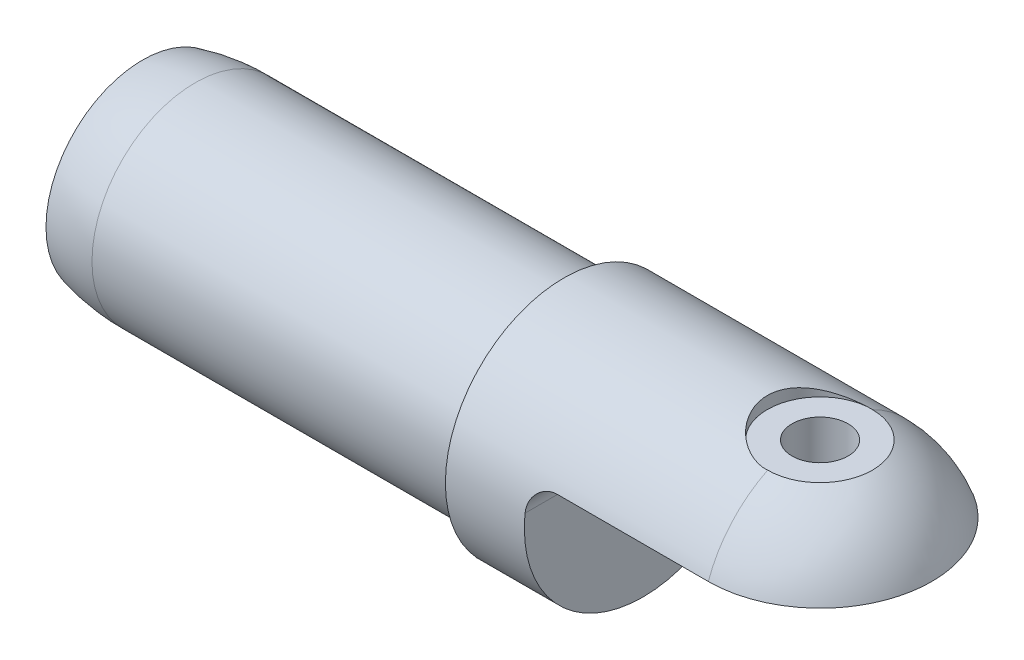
ISO-10303-21;
HEADER;
FILE_DESCRIPTION(('STEP AP214'),'2;1');
FILE_NAME('part.step','',(''),(''),'','','');
FILE_SCHEMA(('AUTOMOTIVE_DESIGN { 1 0 10303 214 1 1 1 1 }'));
ENDSEC;
DATA;
#1=APPLICATION_CONTEXT('core data for automotive mechanical design processes');
#2=APPLICATION_PROTOCOL_DEFINITION('international standard','automotive_design',2000,#1);
#3=PRODUCT_CONTEXT('',#1,'mechanical');
#4=PRODUCT('Part','Part','',(#3));
#5=PRODUCT_RELATED_PRODUCT_CATEGORY('part','',(#4));
#6=PRODUCT_DEFINITION_FORMATION('','',#4);
#7=PRODUCT_DEFINITION_CONTEXT('part definition',#1,'design');
#8=PRODUCT_DEFINITION('design','',#6,#7);
#9=PRODUCT_DEFINITION_SHAPE('','',#8);
#10=(LENGTH_UNIT() NAMED_UNIT(*) SI_UNIT(.MILLI.,.METRE.));
#11=(NAMED_UNIT(*) PLANE_ANGLE_UNIT() SI_UNIT($,.RADIAN.));
#12=(NAMED_UNIT(*) SI_UNIT($,.STERADIAN.) SOLID_ANGLE_UNIT());
#13=UNCERTAINTY_MEASURE_WITH_UNIT(LENGTH_MEASURE(1.E-05),#10,'distance_accuracy_value','');
#14=(GEOMETRIC_REPRESENTATION_CONTEXT(3) GLOBAL_UNCERTAINTY_ASSIGNED_CONTEXT((#13)) GLOBAL_UNIT_ASSIGNED_CONTEXT((#10,
#11,#12)) REPRESENTATION_CONTEXT('',''));
#15=CARTESIAN_POINT('',(0.,0.,0.));
#16=DIRECTION('',(0.,0.,1.));
#17=DIRECTION('',(1.,0.,0.));
#18=AXIS2_PLACEMENT_3D('',#15,#16,#17);
#19=CARTESIAN_POINT('',(61.9324915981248,48.4209803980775,-112.313641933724));
#20=DIRECTION('',(-1.,0.,0.));
#21=DIRECTION('',(0.,0.,1.));
#22=AXIS2_PLACEMENT_3D('',#19,#20,#21);
#23=CYLINDRICAL_SURFACE('',#22,14.2875);
#24=CARTESIAN_POINT('',(143.618891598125,48.4209803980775,-112.313641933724));
#25=DIRECTION('',(-1.,0.,0.));
#26=DIRECTION('',(0.,0.,1.));
#27=AXIS2_PLACEMENT_3D('',#24,#25,#26);
#28=CIRCLE('',#27,14.2875);
#29=CARTESIAN_POINT('',(143.618891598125,61.2352803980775,-118.632373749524));
#30=VERTEX_POINT('',#29);
#31=CARTESIAN_POINT('',(143.618891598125,53.1834803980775,-125.784026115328));
#32=VERTEX_POINT('',#31);
#33=EDGE_CURVE('E109',#30,#32,#28,.T.);
#34=ORIENTED_EDGE('',*,*,#33,.T.);
#35=DIRECTION('',(-1.,0.,0.));
#36=VECTOR('',#35,1.);
#37=CARTESIAN_POINT('',(61.9324915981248,53.1834803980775,-125.784026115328));
#38=LINE('',#37,#36);
#39=CARTESIAN_POINT('',(125.432491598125,53.1834803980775,-125.784026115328));
#40=VERTEX_POINT('',#39);
#41=EDGE_CURVE('E56',#32,#40,#38,.T.);
#42=ORIENTED_EDGE('',*,*,#41,.T.);
#43=CARTESIAN_POINT('',(125.432491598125,53.1834803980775,-125.784026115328));
#44=CARTESIAN_POINT('',(125.346178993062,53.1834917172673,-125.784015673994));
#45=CARTESIAN_POINT('',(125.259873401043,53.179961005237,-125.785270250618));
#46=CARTESIAN_POINT('',(125.087924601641,53.1659032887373,-125.790231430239));
#47=CARTESIAN_POINT('',(125.002281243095,53.1553779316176,-125.79393745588));
#48=CARTESIAN_POINT('',(124.832503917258,53.1274580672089,-125.803709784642));
#49=CARTESIAN_POINT('',(124.748366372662,53.1100830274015,-125.809769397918));
#50=CARTESIAN_POINT('',(124.581969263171,53.0686434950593,-125.824095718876));
#51=CARTESIAN_POINT('',(124.499709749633,53.0445788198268,-125.832362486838));
#52=CARTESIAN_POINT('',(124.256666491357,52.9626659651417,-125.860195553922));
#53=CARTESIAN_POINT('',(124.099393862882,52.8950616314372,-125.882808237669));
#54=CARTESIAN_POINT('',(123.798523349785,52.7360793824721,-125.934196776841));
#55=CARTESIAN_POINT('',(123.654932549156,52.6446892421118,-125.962975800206));
#56=CARTESIAN_POINT('',(123.380245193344,52.4373598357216,-126.025440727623));
#57=CARTESIAN_POINT('',(123.249707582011,52.320718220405,-126.059255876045));
#58=CARTESIAN_POINT('',(123.009681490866,52.0678558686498,-126.128493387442));
#59=CARTESIAN_POINT('',(122.900199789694,51.9316288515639,-126.163916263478));
#60=CARTESIAN_POINT('',(122.700958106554,51.6370488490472,-126.235330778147));
#61=CARTESIAN_POINT('',(122.612180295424,51.4780217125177,-126.271287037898));
#62=CARTESIAN_POINT('',(122.4629238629,51.146581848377,-126.339771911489));
#63=CARTESIAN_POINT('',(122.402424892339,50.9741788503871,-126.372302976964));
#64=CARTESIAN_POINT('',(122.324171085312,50.6691846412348,-126.423750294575));
#65=CARTESIAN_POINT('',(122.299250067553,50.5386073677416,-126.443956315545));
#66=CARTESIAN_POINT('',(122.265896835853,50.2749478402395,-126.480978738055));
#67=CARTESIAN_POINT('',(122.25745846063,50.1418665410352,-126.497796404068));
#68=CARTESIAN_POINT('',(122.257491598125,50.0084803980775,-126.512673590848));
#69=B_SPLINE_CURVE_WITH_KNOTS('',3,(#43,#44,#45,#46,#47,#48,#49,#50,#51,#52,#53,#54,#55,#56,#57,
#58,#59,#60,#61,#62,#63,#64,#65,#66,#67,#68),.UNSPECIFIED.,.F.,.F.,(4,2,2,2,2,2,2,2,2,2,2,2,4),
(0.,0.258844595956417,0.517628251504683,0.775681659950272,1.0337421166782,1.54918864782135,
2.06490062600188,2.59740189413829,3.13007430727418,3.68439190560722,4.2383100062,
4.64066719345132,5.04287394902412),.UNSPECIFIED.);
#70=CARTESIAN_POINT('',(122.257491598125,50.0084803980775,-126.512673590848));
#71=VERTEX_POINT('',#70);
#72=EDGE_CURVE('E49',#40,#71,#69,.T.);
#73=ORIENTED_EDGE('',*,*,#72,.T.);
#74=CARTESIAN_POINT('',(122.257491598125,48.4209803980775,-112.313641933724));
#75=DIRECTION('',(-1.,0.,0.));
#76=DIRECTION('',(0.,0.,1.));
#77=AXIS2_PLACEMENT_3D('',#74,#75,#76);
#78=CIRCLE('',#77,14.2875);
#79=CARTESIAN_POINT('',(122.257491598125,50.0084803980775,-98.1146102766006));
#80=VERTEX_POINT('',#79);
#81=EDGE_CURVE('E100',#71,#80,#78,.T.);
#82=ORIENTED_EDGE('',*,*,#81,.T.);
#83=CARTESIAN_POINT('',(122.257491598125,50.0084803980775,-98.1146102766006));
#84=CARTESIAN_POINT('',(122.257482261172,50.0983889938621,-98.1246540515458));
#85=CARTESIAN_POINT('',(122.261310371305,50.1881905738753,-98.1355669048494));
#86=CARTESIAN_POINT('',(122.276517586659,50.3669213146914,-98.1589949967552));
#87=CARTESIAN_POINT('',(122.287894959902,50.4558506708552,-98.1715098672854));
#88=CARTESIAN_POINT('',(122.31804703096,50.6320457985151,-98.1979847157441));
#89=CARTESIAN_POINT('',(122.336807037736,50.7193145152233,-98.2119417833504));
#90=CARTESIAN_POINT('',(122.38152335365,50.8917476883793,-98.2411287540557));
#91=CARTESIAN_POINT('',(122.407479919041,50.9769120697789,-98.2563587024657));
#92=CARTESIAN_POINT('',(122.495811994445,51.2283234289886,-98.3036303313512));
#93=CARTESIAN_POINT('',(122.568689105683,51.3907149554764,-98.3372883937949));
#94=CARTESIAN_POINT('',(122.740199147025,51.7007066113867,-98.4067591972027));
#95=CARTESIAN_POINT('',(122.838841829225,51.8483011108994,-98.4425727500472));
#96=CARTESIAN_POINT('',(123.061847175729,52.1282427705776,-98.5147208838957));
#97=CARTESIAN_POINT('',(123.186740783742,52.2601698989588,-98.5510489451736));
#98=CARTESIAN_POINT('',(123.457697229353,52.5012084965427,-98.6205715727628));
#99=CARTESIAN_POINT('',(123.603763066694,52.6103167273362,-98.6537656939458));
#100=CARTESIAN_POINT('',(123.912962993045,52.8021676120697,-98.714084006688));
#101=CARTESIAN_POINT('',(124.076056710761,52.8849708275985,-98.7412220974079));
#102=CARTESIAN_POINT('',(124.415006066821,53.0215571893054,-98.7869059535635));
#103=CARTESIAN_POINT('',(124.590845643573,53.0753761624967,-98.8054623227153));
#104=CARTESIAN_POINT('',(124.878871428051,53.136818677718,-98.8268292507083));
#105=CARTESIAN_POINT('',(124.988805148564,53.1542903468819,-98.8329635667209));
#106=CARTESIAN_POINT('',(125.209967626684,53.1776260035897,-98.8411874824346));
#107=CARTESIAN_POINT('',(125.321195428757,53.1834980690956,-98.8432798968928));
#108=CARTESIAN_POINT('',(125.432491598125,53.1834803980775,-98.8432577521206));
#109=B_SPLINE_CURVE_WITH_KNOTS('',3,(#83,#84,#85,#86,#87,#88,#89,#90,#91,#92,#93,#94,#95,#96,
#97,#98,#99,#100,#101,#102,#103,#104,#105,#106,#107,#108),.UNSPECIFIED.,.F.,.F.,(4,2,2,2,2,2,2,
2,2,2,2,2,4),(0.,0.271302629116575,0.542543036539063,0.813246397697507,1.08395939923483,
1.62469718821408,2.16563994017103,2.71880939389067,3.2720572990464,3.82402208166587,
4.37530301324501,4.70911988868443,5.04270421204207),.UNSPECIFIED.);
#110=CARTESIAN_POINT('',(125.432491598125,53.1834803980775,-98.8432577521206));
#111=VERTEX_POINT('',#110);
#112=EDGE_CURVE('E11',#80,#111,#109,.T.);
#113=ORIENTED_EDGE('',*,*,#112,.T.);
#114=DIRECTION('',(-1.,0.,0.));
#115=VECTOR('',#114,1.);
#116=CARTESIAN_POINT('',(61.9324915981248,53.1834803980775,-98.8432577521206));
#117=LINE('',#116,#115);
#118=CARTESIAN_POINT('',(143.618891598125,53.1834803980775,-98.8432577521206));
#119=VERTEX_POINT('',#118);
#120=EDGE_CURVE('E102',#111,#119,#117,.F.);
#121=ORIENTED_EDGE('',*,*,#120,.T.);
#122=CARTESIAN_POINT('',(143.618891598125,61.2352803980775,-105.994910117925));
#123=VERTEX_POINT('',#122);
#124=EDGE_CURVE('E64',#119,#123,#28,.T.);
#125=ORIENTED_EDGE('',*,*,#124,.T.);
#126=DIRECTION('',(-1.,0.,0.));
#127=VECTOR('',#126,1.);
#128=CARTESIAN_POINT('',(61.9324915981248,61.2352803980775,-105.994910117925));
#129=LINE('',#128,#127);
#130=CARTESIAN_POINT('',(142.989504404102,61.2352803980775,-105.994910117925));
#131=VERTEX_POINT('',#130);
#132=EDGE_CURVE('E122',#131,#123,#129,.F.);
#133=ORIENTED_EDGE('',*,*,#132,.F.);
#134=CARTESIAN_POINT('',(142.989504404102,61.2352803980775,-118.632373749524));
#135=CARTESIAN_POINT('',(142.817044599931,61.24371212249,-118.615222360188));
#136=CARTESIAN_POINT('',(142.645498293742,61.2556488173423,-118.590979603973));
#137=CARTESIAN_POINT('',(142.305595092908,61.285914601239,-118.528743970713));
#138=CARTESIAN_POINT('',(142.13723631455,61.3042397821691,-118.490759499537));
#139=CARTESIAN_POINT('',(141.805578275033,61.3465846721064,-118.401644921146));
#140=CARTESIAN_POINT('',(141.642260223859,61.37057931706,-118.350572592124));
#141=CARTESIAN_POINT('',(141.320964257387,61.4235004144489,-118.235730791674));
#142=CARTESIAN_POINT('',(141.162987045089,61.452427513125,-118.171959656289));
#143=CARTESIAN_POINT('',(140.853671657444,61.5142488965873,-118.032450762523));
#144=CARTESIAN_POINT('',(140.702318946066,61.5471338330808,-117.956741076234));
#145=CARTESIAN_POINT('',(140.406635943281,61.615981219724,-117.793827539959));
#146=CARTESIAN_POINT('',(140.262308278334,61.6519448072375,-117.706619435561));
#147=CARTESIAN_POINT('',(139.840748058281,61.7630588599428,-117.428470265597));
#148=CARTESIAN_POINT('',(139.575025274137,61.8414143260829,-117.221043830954));
#149=CARTESIAN_POINT('',(139.063204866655,62.0041141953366,-116.751730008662));
#150=CARTESIAN_POINT('',(138.819599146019,62.0885094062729,-116.487132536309));
#151=CARTESIAN_POINT('',(138.489651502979,62.2089757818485,-116.061405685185));
#152=CARTESIAN_POINT('',(138.385534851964,62.2481286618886,-115.914608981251));
#153=CARTESIAN_POINT('',(138.189838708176,62.3233760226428,-115.612169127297));
#154=CARTESIAN_POINT('',(138.098254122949,62.3594717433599,-115.456529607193));
#155=CARTESIAN_POINT('',(137.927501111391,62.4279751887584,-115.135687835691));
#156=CARTESIAN_POINT('',(137.848469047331,62.4603414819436,-114.970404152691));
#157=CARTESIAN_POINT('',(137.704745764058,62.5200230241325,-114.63290841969));
#158=CARTESIAN_POINT('',(137.640048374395,62.5473404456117,-114.460699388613));
#159=CARTESIAN_POINT('',(137.525673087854,62.5961273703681,-114.110608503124));
#160=CARTESIAN_POINT('',(137.475990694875,62.6175986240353,-113.932728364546));
#161=CARTESIAN_POINT('',(137.392217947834,62.6540473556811,-113.572684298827));
#162=CARTESIAN_POINT('',(137.358126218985,62.6690254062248,-113.390520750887));
#163=CARTESIAN_POINT('',(137.30799328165,62.6911286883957,-113.037728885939));
#164=CARTESIAN_POINT('',(137.290756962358,62.698772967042,-112.867301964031));
#165=CARTESIAN_POINT('',(137.270115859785,62.7079332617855,-112.525451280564));
#166=CARTESIAN_POINT('',(137.266710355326,62.7094495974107,-112.354027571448));
#167=CARTESIAN_POINT('',(137.273769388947,62.7063128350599,-112.011559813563));
#168=CARTESIAN_POINT('',(137.28423110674,62.7016609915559,-111.840515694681));
#169=CARTESIAN_POINT('',(137.318897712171,62.6863173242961,-111.500102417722));
#170=CARTESIAN_POINT('',(137.34310243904,62.675625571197,-111.330733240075));
#171=CARTESIAN_POINT('',(137.403595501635,62.6490990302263,-111.002461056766));
#172=CARTESIAN_POINT('',(137.439295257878,62.6335155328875,-110.843428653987));
#173=CARTESIAN_POINT('',(137.522650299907,62.5974715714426,-110.529041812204));
#174=CARTESIAN_POINT('',(137.570309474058,62.5770095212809,-110.373688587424));
#175=CARTESIAN_POINT('',(137.677131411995,62.5316973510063,-110.067703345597));
#176=CARTESIAN_POINT('',(137.73629104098,62.5068484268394,-109.917070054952));
#177=CARTESIAN_POINT('',(137.865658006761,62.4533139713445,-109.62126857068));
#178=CARTESIAN_POINT('',(137.93586963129,62.4246269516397,-109.476102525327));
#179=CARTESIAN_POINT('',(138.090222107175,62.3626848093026,-109.185611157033));
#180=CARTESIAN_POINT('',(138.174849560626,62.3292817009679,-109.040575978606));
#181=CARTESIAN_POINT('',(138.355008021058,62.2597563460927,-108.75806753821));
#182=CARTESIAN_POINT('',(138.450542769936,62.2236331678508,-108.620596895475));
#183=CARTESIAN_POINT('',(138.651930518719,62.1494941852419,-108.353877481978));
#184=CARTESIAN_POINT('',(138.757788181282,62.1114775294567,-108.224632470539));
#185=CARTESIAN_POINT('',(138.979186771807,62.034438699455,-107.975039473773));
#186=CARTESIAN_POINT('',(139.094728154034,61.9954164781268,-107.854691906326));
#187=CARTESIAN_POINT('',(139.344494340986,61.9141488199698,-107.6142347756));
#188=CARTESIAN_POINT('',(139.479474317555,61.8718947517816,-107.494911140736));
#189=CARTESIAN_POINT('',(139.759234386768,61.7884518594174,-107.2680528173));
#190=CARTESIAN_POINT('',(139.904011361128,61.7472627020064,-107.160514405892));
#191=CARTESIAN_POINT('',(140.202533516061,61.6671497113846,-106.957942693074));
#192=CARTESIAN_POINT('',(140.356273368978,61.6282245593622,-106.862902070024));
#193=CARTESIAN_POINT('',(140.671870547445,61.5538244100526,-106.686007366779));
#194=CARTESIAN_POINT('',(140.833723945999,61.5183477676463,-106.604146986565));
#195=CARTESIAN_POINT('',(141.154689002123,61.4539864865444,-106.458785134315));
#196=CARTESIAN_POINT('',(141.313381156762,61.4248338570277,-106.394476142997));
#197=CARTESIAN_POINT('',(141.636169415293,61.3715016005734,-106.278684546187));
#198=CARTESIAN_POINT('',(141.800264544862,61.3473210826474,-106.227199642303));
#199=CARTESIAN_POINT('',(142.133434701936,61.3046686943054,-106.137416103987));
#200=CARTESIAN_POINT('',(142.302526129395,61.2862186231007,-106.099167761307));
#201=CARTESIAN_POINT('',(142.643937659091,61.2557571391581,-106.036524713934));
#202=CARTESIAN_POINT('',(142.816259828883,61.2437500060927,-106.012139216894));
#203=CARTESIAN_POINT('',(142.989504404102,61.2352803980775,-105.994910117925));
#204=B_SPLINE_CURVE_WITH_KNOTS('',3,(#134,#135,#136,#137,#138,#139,#140,#141,#142,#143,#144,
#145,#146,#147,#148,#149,#150,#151,#152,#153,#154,#155,#156,#157,#158,#159,#160,#161,#162,#163,
#164,#165,#166,#167,#168,#169,#170,#171,#172,#173,#174,#175,#176,#177,#178,#179,#180,#181,#182,
#183,#184,#185,#186,#187,#188,#189,#190,#191,#192,#193,#194,#195,#196,#197,#198,#199,#200,#201,
#202,#203),.UNSPECIFIED.,.F.,.F.,(4,2,2,2,2,2,2,2,2,2,2,2,2,2,2,2,2,2,2,2,2,2,2,2,2,2,2,2,2,2,2,
2,2,2,4),(0.,0.520313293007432,1.04030884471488,1.55804720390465,2.07585344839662,
2.59245980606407,3.10925784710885,4.14314244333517,5.24600090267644,5.79799628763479,
6.34976669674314,6.90717246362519,7.4643378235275,8.02133617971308,8.57828541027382,
9.09202923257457,9.60574626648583,10.1193588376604,10.6329654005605,11.1236109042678,
11.6144161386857,12.1050877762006,12.5959502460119,13.1090286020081,13.6222835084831,
14.1357713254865,14.6492832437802,15.2037881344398,15.7581173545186,16.3121203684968,
16.8658577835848,17.3863266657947,17.9067021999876,18.4290337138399,18.9517117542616),.UNSPECIFIED.);
#205=CARTESIAN_POINT('',(142.989504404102,61.2352803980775,-118.632373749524));
#206=VERTEX_POINT('',#205);
#207=EDGE_CURVE('E146',#206,#131,#204,.T.);
#208=ORIENTED_EDGE('',*,*,#207,.F.);
#209=DIRECTION('',(-1.,0.,0.));
#210=VECTOR('',#209,1.);
#211=CARTESIAN_POINT('',(61.9324915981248,61.2352803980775,-118.632373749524));
#212=LINE('',#211,#210);
#213=EDGE_CURVE('E124',#30,#206,#212,.T.);
#214=ORIENTED_EDGE('',*,*,#213,.F.);
#215=EDGE_LOOP('',(#34,#42,#73,#82,#113,#121,#125,#133,#208,#214));
#216=FACE_BOUND('',#215,.T.);
#217=CARTESIAN_POINT('',(112.732491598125,48.4209803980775,-112.313641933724));
#218=DIRECTION('',(-1.,0.,0.));
#219=DIRECTION('',(0.,0.,1.));
#220=AXIS2_PLACEMENT_3D('',#217,#218,#219);
#221=CIRCLE('',#220,14.2875);
#222=CARTESIAN_POINT('',(112.732491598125,48.4209803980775,-98.0261419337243));
#223=VERTEX_POINT('',#222);
#224=EDGE_CURVE('E137',#223,#223,#221,.T.);
#225=ORIENTED_EDGE('',*,*,#224,.F.);
#226=EDGE_LOOP('',(#225));
#227=FACE_BOUND('',#226,.T.);
#228=ADVANCED_FACE('F37',(#216,#227),#23,.T.);
#229=CARTESIAN_POINT('',(143.618891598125,48.4209803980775,-112.313641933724));
#230=DIRECTION('',(-1.,0.,0.));
#231=DIRECTION('',(0.,0.,-1.));
#232=AXIS2_PLACEMENT_3D('',#229,#230,#231);
#233=SPHERICAL_SURFACE('',#232,14.2875);
#234=ORIENTED_EDGE('',*,*,#124,.F.);
#235=CARTESIAN_POINT('',(143.618891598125,53.1834803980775,-112.313641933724));
#236=DIRECTION('',(0.,1.,0.));
#237=DIRECTION('',(0.,0.,1.));
#238=AXIS2_PLACEMENT_3D('',#235,#236,#237);
#239=CIRCLE('',#238,13.4703841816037);
#240=EDGE_CURVE('E115',#32,#119,#239,.F.);
#241=ORIENTED_EDGE('',*,*,#240,.F.);
#242=ORIENTED_EDGE('',*,*,#33,.F.);
#243=CARTESIAN_POINT('',(143.618891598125,61.2352803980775,-112.313641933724));
#244=DIRECTION('',(0.,1.,0.));
#245=DIRECTION('',(0.,0.,1.));
#246=AXIS2_PLACEMENT_3D('',#243,#244,#245);
#247=CIRCLE('',#246,6.31873181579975);
#248=EDGE_CURVE('E119',#30,#123,#247,.F.);
#249=ORIENTED_EDGE('',*,*,#248,.T.);
#250=EDGE_LOOP('',(#234,#241,#242,#249));
#251=FACE_BOUND('',#250,.T.);
#252=ADVANCED_FACE('F168',(#251),#233,.T.);
#253=CARTESIAN_POINT('',(143.618891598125,23.0209803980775,-112.313641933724));
#254=DIRECTION('',(0.,1.,0.));
#255=DIRECTION('',(0.,0.,1.));
#256=AXIS2_PLACEMENT_3D('',#253,#254,#255);
#257=CYLINDRICAL_SURFACE('',#256,3.3782);
#258=CARTESIAN_POINT('',(143.618891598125,53.1834803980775,-112.313641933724));
#259=DIRECTION('',(0.,1.,0.));
#260=DIRECTION('',(0.,0.,1.));
#261=AXIS2_PLACEMENT_3D('',#258,#259,#260);
#262=CIRCLE('',#261,3.3782);
#263=CARTESIAN_POINT('',(143.618891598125,53.1834803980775,-108.935441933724));
#264=VERTEX_POINT('',#263);
#265=EDGE_CURVE('E103',#264,#264,#262,.F.);
#266=ORIENTED_EDGE('',*,*,#265,.T.);
#267=EDGE_LOOP('',(#266));
#268=FACE_BOUND('',#267,.T.);
#269=CARTESIAN_POINT('',(143.618891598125,61.2352803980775,-112.313641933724));
#270=DIRECTION('',(0.,1.,0.));
#271=DIRECTION('',(0.,0.,1.));
#272=AXIS2_PLACEMENT_3D('',#269,#270,#271);
#273=CIRCLE('',#272,3.3782);
#274=CARTESIAN_POINT('',(143.618891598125,61.2352803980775,-108.935441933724));
#275=VERTEX_POINT('',#274);
#276=EDGE_CURVE('E113',#275,#275,#273,.F.);
#277=ORIENTED_EDGE('',*,*,#276,.F.);
#278=EDGE_LOOP('',(#277));
#279=FACE_BOUND('',#278,.T.);
#280=ADVANCED_FACE('F165',(#268,#279),#257,.F.);
#281=CARTESIAN_POINT('',(112.732491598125,48.4209803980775,-124.759641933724));
#282=DIRECTION('',(-1.,0.,0.));
#283=DIRECTION('',(0.,0.,1.));
#284=AXIS2_PLACEMENT_3D('',#281,#282,#283);
#285=PLANE('',#284);
#286=CARTESIAN_POINT('',(112.732491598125,48.4209803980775,-112.313641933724));
#287=DIRECTION('',(-1.,0.,0.));
#288=DIRECTION('',(0.,0.,1.));
#289=AXIS2_PLACEMENT_3D('',#286,#287,#288);
#290=CIRCLE('',#289,12.446);
#291=CARTESIAN_POINT('',(112.732491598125,48.4209803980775,-99.8676419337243));
#292=VERTEX_POINT('',#291);
#293=EDGE_CURVE('E140',#292,#292,#290,.T.);
#294=ORIENTED_EDGE('',*,*,#293,.F.);
#295=EDGE_LOOP('',(#294));
#296=FACE_BOUND('',#295,.T.);
#297=ORIENTED_EDGE('',*,*,#224,.T.);
#298=EDGE_LOOP('',(#297));
#299=FACE_BOUND('',#298,.T.);
#300=ADVANCED_FACE('F163',(#296,#299),#285,.T.);
#301=CARTESIAN_POINT('',(143.618891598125,62.7084803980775,-112.313641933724));
#302=DIRECTION('',(0.,-1.,0.));
#303=DIRECTION('',(0.,0.,-1.));
#304=AXIS2_PLACEMENT_3D('',#301,#302,#303);
#305=CYLINDRICAL_SURFACE('',#304,6.35);
#306=CARTESIAN_POINT('',(143.618891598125,61.2352803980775,-112.313641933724));
#307=DIRECTION('',(0.,1.,0.));
#308=DIRECTION('',(0.,0.,1.));
#309=AXIS2_PLACEMENT_3D('',#306,#307,#308);
#310=CIRCLE('',#309,6.35);
#311=EDGE_CURVE('E110',#206,#131,#310,.T.);
#312=ORIENTED_EDGE('',*,*,#311,.F.);
#313=ORIENTED_EDGE('',*,*,#207,.T.);
#314=EDGE_LOOP('',(#312,#313));
#315=FACE_BOUND('',#314,.T.);
#316=ADVANCED_FACE('F157',(#315),#305,.F.);
#317=CARTESIAN_POINT('',(143.618891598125,61.2352803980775,-112.313641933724));
#318=DIRECTION('',(0.,1.,0.));
#319=DIRECTION('',(0.,0.,1.));
#320=AXIS2_PLACEMENT_3D('',#317,#318,#319);
#321=PLANE('',#320);
#322=ORIENTED_EDGE('',*,*,#276,.T.);
#323=EDGE_LOOP('',(#322));
#324=FACE_BOUND('',#323,.T.);
#325=ORIENTED_EDGE('',*,*,#213,.T.);
#326=ORIENTED_EDGE('',*,*,#311,.T.);
#327=ORIENTED_EDGE('',*,*,#132,.T.);
#328=ORIENTED_EDGE('',*,*,#248,.F.);
#329=EDGE_LOOP('',(#325,#326,#327,#328));
#330=FACE_BOUND('',#329,.T.);
#331=ADVANCED_FACE('F162',(#324,#330),#321,.T.);
#332=CARTESIAN_POINT('',(125.432491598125,50.0084803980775,-128.188641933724));
#333=DIRECTION('',(0.,0.,1.));
#334=DIRECTION('',(1.,0.,0.));
#335=AXIS2_PLACEMENT_3D('',#332,#333,#334);
#336=CYLINDRICAL_SURFACE('',#335,3.175);
#337=DIRECTION('',(0.,0.,1.));
#338=VECTOR('',#337,1.);
#339=CARTESIAN_POINT('',(122.257491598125,50.0084803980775,-128.188641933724));
#340=LINE('',#339,#338);
#341=EDGE_CURVE('E98',#71,#80,#340,.T.);
#342=ORIENTED_EDGE('',*,*,#341,.F.);
#343=ORIENTED_EDGE('',*,*,#72,.F.);
#344=DIRECTION('',(0.,0.,1.));
#345=VECTOR('',#344,1.);
#346=CARTESIAN_POINT('',(125.432491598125,53.1834803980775,-128.188641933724));
#347=LINE('',#346,#345);
#348=EDGE_CURVE('E96',#40,#111,#347,.T.);
#349=ORIENTED_EDGE('',*,*,#348,.T.);
#350=ORIENTED_EDGE('',*,*,#112,.F.);
#351=EDGE_LOOP('',(#342,#343,#349,#350));
#352=FACE_BOUND('',#351,.T.);
#353=ADVANCED_FACE('F95',(#352),#336,.F.);
#354=CARTESIAN_POINT('',(122.257491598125,50.0084803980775,-128.188641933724));
#355=DIRECTION('',(-1.,0.,0.));
#356=DIRECTION('',(0.,0.,1.));
#357=AXIS2_PLACEMENT_3D('',#354,#355,#356);
#358=PLANE('',#357);
#359=ORIENTED_EDGE('',*,*,#341,.T.);
#360=ORIENTED_EDGE('',*,*,#81,.F.);
#361=EDGE_LOOP('',(#359,#360));
#362=FACE_BOUND('',#361,.T.);
#363=ADVANCED_FACE('F239',(#362),#358,.F.);
#364=CARTESIAN_POINT('',(125.432491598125,53.1834803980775,-128.188641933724));
#365=DIRECTION('',(0.,1.,0.));
#366=DIRECTION('',(0.,0.,1.));
#367=AXIS2_PLACEMENT_3D('',#364,#365,#366);
#368=PLANE('',#367);
#369=ORIENTED_EDGE('',*,*,#265,.F.);
#370=EDGE_LOOP('',(#369));
#371=FACE_BOUND('',#370,.T.);
#372=ORIENTED_EDGE('',*,*,#240,.T.);
#373=ORIENTED_EDGE('',*,*,#120,.F.);
#374=ORIENTED_EDGE('',*,*,#348,.F.);
#375=ORIENTED_EDGE('',*,*,#41,.F.);
#376=EDGE_LOOP('',(#372,#373,#374,#375));
#377=FACE_BOUND('',#376,.T.);
#378=ADVANCED_FACE('F101',(#371,#377),#368,.F.);
#379=CARTESIAN_POINT('',(118.265375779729,48.4209803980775,-112.313641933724));
#380=DIRECTION('',(-1.,0.,0.));
#381=DIRECTION('',(0.,-1.,0.));
#382=AXIS2_PLACEMENT_3D('',#379,#380,#381);
#383=CONICAL_SURFACE('',#382,0.,1.17809724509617);
#384=CARTESIAN_POINT('',(114.319991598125,48.4209803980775,-112.313641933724));
#385=DIRECTION('',(1.,0.,0.));
#386=DIRECTION('',(0.,1.,0.));
#387=AXIS2_PLACEMENT_3D('',#384,#385,#386);
#388=CIRCLE('',#387,9.52500000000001);
#389=CARTESIAN_POINT('',(114.319991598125,57.9459803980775,-112.313641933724));
#390=VERTEX_POINT('',#389);
#391=EDGE_CURVE('E131',#390,#390,#388,.T.);
#392=ORIENTED_EDGE('',*,*,#391,.F.);
#393=EDGE_LOOP('',(#392));
#394=FACE_BOUND('',#393,.T.);
#395=CARTESIAN_POINT('',(118.265375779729,48.4209803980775,-112.313641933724));
#396=VERTEX_POINT('',#395);
#397=VERTEX_LOOP('',#396);
#398=FACE_BOUND('',#397,.T.);
#399=ADVANCED_FACE('F179',(#394,#398),#383,.F.);
#400=CARTESIAN_POINT('',(61.9324915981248,62.7084803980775,-112.313641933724));
#401=DIRECTION('',(1.,0.,0.));
#402=DIRECTION('',(0.,0.,-1.));
#403=AXIS2_PLACEMENT_3D('',#400,#401,#402);
#404=PLANE('',#403);
#405=CARTESIAN_POINT('',(61.9324915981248,48.4209803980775,-112.313641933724));
#406=DIRECTION('',(-1.,0.,0.));
#407=DIRECTION('',(0.,0.,1.));
#408=AXIS2_PLACEMENT_3D('',#405,#406,#407);
#409=CIRCLE('',#408,11.6394442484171);
#410=CARTESIAN_POINT('',(61.9324915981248,48.4209803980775,-100.674197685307));
#411=VERTEX_POINT('',#410);
#412=EDGE_CURVE('E134',#411,#411,#409,.T.);
#413=ORIENTED_EDGE('',*,*,#412,.T.);
#414=EDGE_LOOP('',(#413));
#415=FACE_BOUND('',#414,.T.);
#416=CARTESIAN_POINT('',(61.9324915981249,48.4209803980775,-112.313641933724));
#417=DIRECTION('',(1.,0.,0.));
#418=DIRECTION('',(0.,1.,0.));
#419=AXIS2_PLACEMENT_3D('',#416,#417,#418);
#420=CIRCLE('',#419,9.525);
#421=CARTESIAN_POINT('',(61.9324915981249,57.9459803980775,-112.313641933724));
#422=VERTEX_POINT('',#421);
#423=EDGE_CURVE('E128',#422,#422,#420,.T.);
#424=ORIENTED_EDGE('',*,*,#423,.T.);
#425=EDGE_LOOP('',(#424));
#426=FACE_BOUND('',#425,.T.);
#427=ADVANCED_FACE('F39',(#415,#426),#404,.F.);
#428=CARTESIAN_POINT('',(68.2824915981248,48.4209803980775,-112.313641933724));
#429=DIRECTION('',(-1.,0.,0.));
#430=DIRECTION('',(0.,0.,1.));
#431=AXIS2_PLACEMENT_3D('',#428,#429,#430);
#432=DEGENERATE_TOROIDAL_SURFACE('',#431,12.954,25.4,.F.);
#433=ORIENTED_EDGE('',*,*,#412,.F.);
#434=EDGE_LOOP('',(#433));
#435=FACE_BOUND('',#434,.T.);
#436=CARTESIAN_POINT('',(68.2824915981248,48.4209803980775,-112.313641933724));
#437=DIRECTION('',(-1.,0.,0.));
#438=DIRECTION('',(0.,0.,1.));
#439=AXIS2_PLACEMENT_3D('',#436,#437,#438);
#440=CIRCLE('',#439,12.446);
#441=CARTESIAN_POINT('',(68.2824915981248,48.4209803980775,-99.8676419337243));
#442=VERTEX_POINT('',#441);
#443=EDGE_CURVE('E143',#442,#442,#440,.T.);
#444=ORIENTED_EDGE('',*,*,#443,.T.);
#445=EDGE_LOOP('',(#444));
#446=FACE_BOUND('',#445,.T.);
#447=ADVANCED_FACE('F177',(#435,#446),#432,.F.);
#448=CARTESIAN_POINT('',(118.265375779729,48.4209803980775,-112.313641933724));
#449=DIRECTION('',(1.,0.,0.));
#450=DIRECTION('',(0.,1.,0.));
#451=AXIS2_PLACEMENT_3D('',#448,#449,#450);
#452=CYLINDRICAL_SURFACE('',#451,9.525);
#453=ORIENTED_EDGE('',*,*,#391,.T.);
#454=EDGE_LOOP('',(#453));
#455=FACE_BOUND('',#454,.T.);
#456=ORIENTED_EDGE('',*,*,#423,.F.);
#457=EDGE_LOOP('',(#456));
#458=FACE_BOUND('',#457,.T.);
#459=ADVANCED_FACE('F173',(#455,#458),#452,.F.);
#460=CARTESIAN_POINT('',(61.9324915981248,48.4209803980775,-112.313641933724));
#461=DIRECTION('',(-1.,0.,0.));
#462=DIRECTION('',(0.,0.,1.));
#463=AXIS2_PLACEMENT_3D('',#460,#461,#462);
#464=CYLINDRICAL_SURFACE('',#463,12.446);
#465=ORIENTED_EDGE('',*,*,#293,.T.);
#466=EDGE_LOOP('',(#465));
#467=FACE_BOUND('',#466,.T.);
#468=ORIENTED_EDGE('',*,*,#443,.F.);
#469=EDGE_LOOP('',(#468));
#470=FACE_BOUND('',#469,.T.);
#471=ADVANCED_FACE('F176',(#467,#470),#464,.T.);
#472=CLOSED_SHELL('',(#228,#252,#280,#300,#316,#331,#353,#363,#378,#399,#427,#447,#459,#471));
#473=MANIFOLD_SOLID_BREP('B2',#472);
#474=ADVANCED_BREP_SHAPE_REPRESENTATION('',(#18,#473),#14);
#475=SHAPE_DEFINITION_REPRESENTATION(#9,#474);
ENDSEC;
END-ISO-10303-21;
